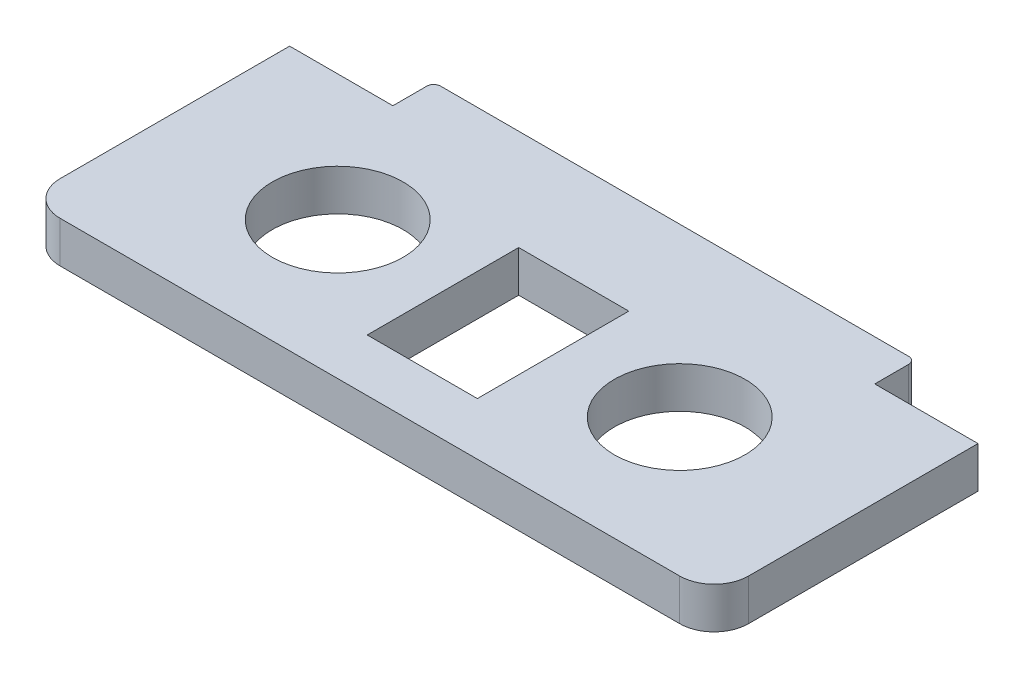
from build123d import *

# Parameters (mm, degrees)
SKETCH2_R           = 9.5
SKETCH2_W           = 16
SKETCH2_H           = 22
BOSS_EXTRUDE1_DEPTH = 6
FILLET9_R           = 5
FILLET10_R          = 1


with BuildPart() as part:
    # Sketch2 → Boss-Extrude1 (new body)
    with BuildSketch(Plane(origin=(0, 0, 0), x_dir=(1, 0, 0), z_dir=(0, 1, 0))):
        Polygon((-50, 14), (-50, -20), (50, -20), (50, 14), (50, 18.332034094), (35, 18.332034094), (35, 24.265947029), (-35, 24.265947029), (-35, 18.332034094), (-50, 18.332034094), align=None)
        with Locations(Location((-24.68, 0, 0), (0, 0, 270))):
            Circle(SKETCH2_R, mode=Mode.SUBTRACT)
        with Locations(Location((25, 0, 0), (0, 0, 270))):
            Circle(SKETCH2_R, mode=Mode.SUBTRACT)
        with Locations((-0.021711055, -1.370831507)):
            Rectangle(SKETCH2_W, SKETCH2_H, mode=Mode.SUBTRACT)
    extrude(amount=BOSS_EXTRUDE1_DEPTH)

    # Fillet9
    fillet9_edges = [part.edges().sort_by_distance(p)[0] for p in [
        (50, 3, 20),
        (-50, 3, 20),
    ]]
    fillet(fillet9_edges, radius=FILLET9_R)

    # Fillet10
    fillet10_edges = [part.edges().sort_by_distance(p)[0] for p in [
        (-35, 3, -24.265947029),
        (35, 3, -24.265947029),
    ]]
    fillet(fillet10_edges, radius=FILLET10_R)


solid = part.part
